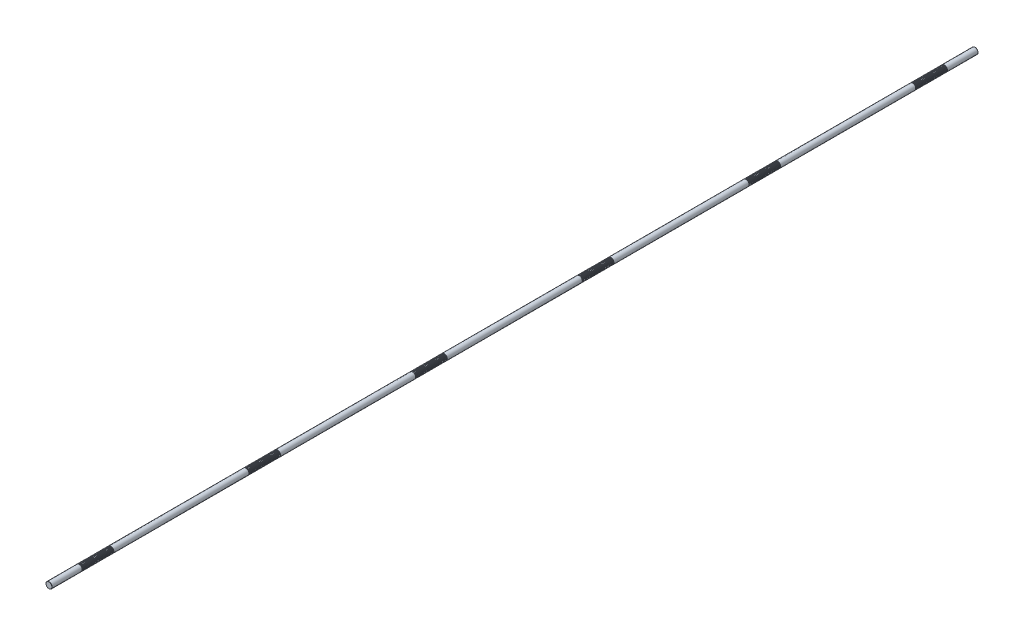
from build123d import *

# Parameters (mm, degrees)
SKETCH1_R           = 10
BOSS_EXTRUDE1_DEPTH = 1500
CHAMFER1_SIZE       = 0.5
LPATTERN1_COUNT     = 26
LPATTERN1_PITCH     = 4
LPATTERN2_COUNT     = 6
LPATTERN2_PITCH     = 540


with BuildPart() as part:
    # Sketch1 → Boss-Extrude1 (new, symmetric)
    with BuildSketch(Plane.XY):
        Circle(SKETCH1_R)
    extrude(amount=BOSS_EXTRUDE1_DEPTH, both=True)

    # Chamfer1
    chamfer1_edges = [part.edges().sort_by_distance(p)[0] for p in [
        (-10, 0, -1500),
        (-10, 0, 1500),
    ]]
    chamfer(chamfer1_edges, length=CHAMFER1_SIZE)

    # Sketch2 → Cut-Revolve1 (revolve, cut)
    with BuildSketch(Plane(origin=(0, 0, 0), x_dir=(0, 0, -1), z_dir=(1, 0, 0)), mode=Mode.PRIVATE) as cut_revolve1_sk:
        Polygon((1400.301442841, 10), (1397.698557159, 10), (1398.301442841, 7.75), (1399.698557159, 7.75), align=None)
    cut_revolve1 = revolve(cut_revolve1_sk.sketch.rotate(Axis((0, 0, 1500), (0, 0, -1)), 90), axis=Axis((0, 0, 1500), (0, 0, -1)), mode=Mode.SUBTRACT)

    # LPattern1: Cut-Revolve1 ×26
    with Locations(*[(0, 0, i * LPATTERN1_PITCH) for i in range(1, LPATTERN1_COUNT)]):
        add(cut_revolve1, mode=Mode.SUBTRACT)

    # LPattern2: Cut-Revolve1 ×6
    with Locations(*[(0, 0, i * LPATTERN2_PITCH) for i in range(1, LPATTERN2_COUNT)]):
        add(cut_revolve1, mode=Mode.SUBTRACT)

    # LPattern2 copy 1 sketch → LPattern2 copy 1 (revolve, cut)
    with BuildSketch(Plane(origin=(0, 0, 544), x_dir=(0, 0, -1), z_dir=(1, 0, 0))):
        Polygon((1400.301442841, 10), (1397.698557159, 10), (1398.301442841, 7.75), (1399.698557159, 7.75), align=None)
    revolve(axis=Axis((0, 0, 2044), (0, 0, -1)), mode=Mode.SUBTRACT)

    # LPattern2 copy 2 sketch → LPattern2 copy 2 (revolve, cut)
    with BuildSketch(Plane(origin=(0, 0, 1084), x_dir=(0, 0, -1), z_dir=(1, 0, 0))):
        Polygon((1400.301442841, 10), (1397.698557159, 10), (1398.301442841, 7.75), (1399.698557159, 7.75), align=None)
    revolve(axis=Axis((0, 0, 2584), (0, 0, -1)), mode=Mode.SUBTRACT)

    # LPattern2 copy 3 sketch → LPattern2 copy 3 (revolve, cut)
    with BuildSketch(Plane(origin=(0, 0, 1624), x_dir=(0, 0, -1), z_dir=(1, 0, 0))):
        Polygon((1400.301442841, 10), (1397.698557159, 10), (1398.301442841, 7.75), (1399.698557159, 7.75), align=None)
    revolve(axis=Axis((0, 0, 3124), (0, 0, -1)), mode=Mode.SUBTRACT)

    # LPattern2 copy 4 sketch → LPattern2 copy 4 (revolve, cut)
    with BuildSketch(Plane(origin=(0, 0, 2164), x_dir=(0, 0, -1), z_dir=(1, 0, 0))):
        Polygon((1400.301442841, 10), (1397.698557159, 10), (1398.301442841, 7.75), (1399.698557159, 7.75), align=None)
    revolve(axis=Axis((0, 0, 3664), (0, 0, -1)), mode=Mode.SUBTRACT)

    # LPattern2 copy 5 sketch → LPattern2 copy 5 (revolve, cut)
    with BuildSketch(Plane(origin=(0, 0, 2704), x_dir=(0, 0, -1), z_dir=(1, 0, 0))):
        Polygon((1400.301442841, 10), (1397.698557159, 10), (1398.301442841, 7.75), (1399.698557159, 7.75), align=None)
    revolve(axis=Axis((0, 0, 4204), (0, 0, -1)), mode=Mode.SUBTRACT)

    # LPattern2 copy 6 sketch → LPattern2 copy 6 (revolve, cut)
    with BuildSketch(Plane(origin=(0, 0, 548), x_dir=(0, 0, -1), z_dir=(1, 0, 0))):
        Polygon((1400.301442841, 10), (1397.698557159, 10), (1398.301442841, 7.75), (1399.698557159, 7.75), align=None)
    revolve(axis=Axis((0, 0, 2048), (0, 0, -1)), mode=Mode.SUBTRACT)

    # LPattern2 copy 7 sketch → LPattern2 copy 7 (revolve, cut)
    with BuildSketch(Plane(origin=(0, 0, 1088), x_dir=(0, 0, -1), z_dir=(1, 0, 0))):
        Polygon((1400.301442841, 10), (1397.698557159, 10), (1398.301442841, 7.75), (1399.698557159, 7.75), align=None)
    revolve(axis=Axis((0, 0, 2588), (0, 0, -1)), mode=Mode.SUBTRACT)

    # LPattern2 copy 8 sketch → LPattern2 copy 8 (revolve, cut)
    with BuildSketch(Plane(origin=(0, 0, 1628), x_dir=(0, 0, -1), z_dir=(1, 0, 0))):
        Polygon((1400.301442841, 10), (1397.698557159, 10), (1398.301442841, 7.75), (1399.698557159, 7.75), align=None)
    revolve(axis=Axis((0, 0, 3128), (0, 0, -1)), mode=Mode.SUBTRACT)

    # LPattern2 copy 9 sketch → LPattern2 copy 9 (revolve, cut)
    with BuildSketch(Plane(origin=(0, 0, 2168), x_dir=(0, 0, -1), z_dir=(1, 0, 0))):
        Polygon((1400.301442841, 10), (1397.698557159, 10), (1398.301442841, 7.75), (1399.698557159, 7.75), align=None)
    revolve(axis=Axis((0, 0, 3668), (0, 0, -1)), mode=Mode.SUBTRACT)

    # LPattern2 copy 10 sketch → LPattern2 copy 10 (revolve, cut)
    with BuildSketch(Plane(origin=(0, 0, 2708), x_dir=(0, 0, -1), z_dir=(1, 0, 0))):
        Polygon((1400.301442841, 10), (1397.698557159, 10), (1398.301442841, 7.75), (1399.698557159, 7.75), align=None)
    revolve(axis=Axis((0, 0, 4208), (0, 0, -1)), mode=Mode.SUBTRACT)

    # LPattern2 copy 11 sketch → LPattern2 copy 11 (revolve, cut)
    with BuildSketch(Plane(origin=(0, 0, 552), x_dir=(0, 0, -1), z_dir=(1, 0, 0))):
        Polygon((1400.301442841, 10), (1397.698557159, 10), (1398.301442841, 7.75), (1399.698557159, 7.75), align=None)
    revolve(axis=Axis((0, 0, 2052), (0, 0, -1)), mode=Mode.SUBTRACT)

    # LPattern2 copy 12 sketch → LPattern2 copy 12 (revolve, cut)
    with BuildSketch(Plane(origin=(0, 0, 1092), x_dir=(0, 0, -1), z_dir=(1, 0, 0))):
        Polygon((1400.301442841, 10), (1397.698557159, 10), (1398.301442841, 7.75), (1399.698557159, 7.75), align=None)
    revolve(axis=Axis((0, 0, 2592), (0, 0, -1)), mode=Mode.SUBTRACT)

    # LPattern2 copy 13 sketch → LPattern2 copy 13 (revolve, cut)
    with BuildSketch(Plane(origin=(0, 0, 1632), x_dir=(0, 0, -1), z_dir=(1, 0, 0))):
        Polygon((1400.301442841, 10), (1397.698557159, 10), (1398.301442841, 7.75), (1399.698557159, 7.75), align=None)
    revolve(axis=Axis((0, 0, 3132), (0, 0, -1)), mode=Mode.SUBTRACT)

    # LPattern2 copy 14 sketch → LPattern2 copy 14 (revolve, cut)
    with BuildSketch(Plane(origin=(0, 0, 2172), x_dir=(0, 0, -1), z_dir=(1, 0, 0))):
        Polygon((1400.301442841, 10), (1397.698557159, 10), (1398.301442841, 7.75), (1399.698557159, 7.75), align=None)
    revolve(axis=Axis((0, 0, 3672), (0, 0, -1)), mode=Mode.SUBTRACT)

    # LPattern2 copy 15 sketch → LPattern2 copy 15 (revolve, cut)
    with BuildSketch(Plane(origin=(0, 0, 2712), x_dir=(0, 0, -1), z_dir=(1, 0, 0))):
        Polygon((1400.301442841, 10), (1397.698557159, 10), (1398.301442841, 7.75), (1399.698557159, 7.75), align=None)
    revolve(axis=Axis((0, 0, 4212), (0, 0, -1)), mode=Mode.SUBTRACT)

    # LPattern2 copy 16 sketch → LPattern2 copy 16 (revolve, cut)
    with BuildSketch(Plane(origin=(0, 0, 556), x_dir=(0, 0, -1), z_dir=(1, 0, 0))):
        Polygon((1400.301442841, 10), (1397.698557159, 10), (1398.301442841, 7.75), (1399.698557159, 7.75), align=None)
    revolve(axis=Axis((0, 0, 2056), (0, 0, -1)), mode=Mode.SUBTRACT)

    # LPattern2 copy 17 sketch → LPattern2 copy 17 (revolve, cut)
    with BuildSketch(Plane(origin=(0, 0, 1096), x_dir=(0, 0, -1), z_dir=(1, 0, 0))):
        Polygon((1400.301442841, 10), (1397.698557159, 10), (1398.301442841, 7.75), (1399.698557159, 7.75), align=None)
    revolve(axis=Axis((0, 0, 2596), (0, 0, -1)), mode=Mode.SUBTRACT)

    # LPattern2 copy 18 sketch → LPattern2 copy 18 (revolve, cut)
    with BuildSketch(Plane(origin=(0, 0, 1636), x_dir=(0, 0, -1), z_dir=(1, 0, 0))):
        Polygon((1400.301442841, 10), (1397.698557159, 10), (1398.301442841, 7.75), (1399.698557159, 7.75), align=None)
    revolve(axis=Axis((0, 0, 3136), (0, 0, -1)), mode=Mode.SUBTRACT)

    # LPattern2 copy 19 sketch → LPattern2 copy 19 (revolve, cut)
    with BuildSketch(Plane(origin=(0, 0, 2176), x_dir=(0, 0, -1), z_dir=(1, 0, 0))):
        Polygon((1400.301442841, 10), (1397.698557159, 10), (1398.301442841, 7.75), (1399.698557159, 7.75), align=None)
    revolve(axis=Axis((0, 0, 3676), (0, 0, -1)), mode=Mode.SUBTRACT)

    # LPattern2 copy 20 sketch → LPattern2 copy 20 (revolve, cut)
    with BuildSketch(Plane(origin=(0, 0, 2716), x_dir=(0, 0, -1), z_dir=(1, 0, 0))):
        Polygon((1400.301442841, 10), (1397.698557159, 10), (1398.301442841, 7.75), (1399.698557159, 7.75), align=None)
    revolve(axis=Axis((0, 0, 4216), (0, 0, -1)), mode=Mode.SUBTRACT)

    # LPattern2 copy 21 sketch → LPattern2 copy 21 (revolve, cut)
    with BuildSketch(Plane(origin=(0, 0, 560), x_dir=(0, 0, -1), z_dir=(1, 0, 0))):
        Polygon((1400.301442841, 10), (1397.698557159, 10), (1398.301442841, 7.75), (1399.698557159, 7.75), align=None)
    revolve(axis=Axis((0, 0, 2060), (0, 0, -1)), mode=Mode.SUBTRACT)

    # LPattern2 copy 22 sketch → LPattern2 copy 22 (revolve, cut)
    with BuildSketch(Plane(origin=(0, 0, 1100), x_dir=(0, 0, -1), z_dir=(1, 0, 0))):
        Polygon((1400.301442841, 10), (1397.698557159, 10), (1398.301442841, 7.75), (1399.698557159, 7.75), align=None)
    revolve(axis=Axis((0, 0, 2600), (0, 0, -1)), mode=Mode.SUBTRACT)

    # LPattern2 copy 23 sketch → LPattern2 copy 23 (revolve, cut)
    with BuildSketch(Plane(origin=(0, 0, 1640), x_dir=(0, 0, -1), z_dir=(1, 0, 0))):
        Polygon((1400.301442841, 10), (1397.698557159, 10), (1398.301442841, 7.75), (1399.698557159, 7.75), align=None)
    revolve(axis=Axis((0, 0, 3140), (0, 0, -1)), mode=Mode.SUBTRACT)

    # LPattern2 copy 24 sketch → LPattern2 copy 24 (revolve, cut)
    with BuildSketch(Plane(origin=(0, 0, 2180), x_dir=(0, 0, -1), z_dir=(1, 0, 0))):
        Polygon((1400.301442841, 10), (1397.698557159, 10), (1398.301442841, 7.75), (1399.698557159, 7.75), align=None)
    revolve(axis=Axis((0, 0, 3680), (0, 0, -1)), mode=Mode.SUBTRACT)

    # LPattern2 copy 25 sketch → LPattern2 copy 25 (revolve, cut)
    with BuildSketch(Plane(origin=(0, 0, 2720), x_dir=(0, 0, -1), z_dir=(1, 0, 0))):
        Polygon((1400.301442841, 10), (1397.698557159, 10), (1398.301442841, 7.75), (1399.698557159, 7.75), align=None)
    revolve(axis=Axis((0, 0, 4220), (0, 0, -1)), mode=Mode.SUBTRACT)

    # LPattern2 copy 26 sketch → LPattern2 copy 26 (revolve, cut)
    with BuildSketch(Plane(origin=(0, 0, 564), x_dir=(0, 0, -1), z_dir=(1, 0, 0))):
        Polygon((1400.301442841, 10), (1397.698557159, 10), (1398.301442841, 7.75), (1399.698557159, 7.75), align=None)
    revolve(axis=Axis((0, 0, 2064), (0, 0, -1)), mode=Mode.SUBTRACT)

    # LPattern2 copy 27 sketch → LPattern2 copy 27 (revolve, cut)
    with BuildSketch(Plane(origin=(0, 0, 1104), x_dir=(0, 0, -1), z_dir=(1, 0, 0))):
        Polygon((1400.301442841, 10), (1397.698557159, 10), (1398.301442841, 7.75), (1399.698557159, 7.75), align=None)
    revolve(axis=Axis((0, 0, 2604), (0, 0, -1)), mode=Mode.SUBTRACT)

    # LPattern2 copy 28 sketch → LPattern2 copy 28 (revolve, cut)
    with BuildSketch(Plane(origin=(0, 0, 1644), x_dir=(0, 0, -1), z_dir=(1, 0, 0))):
        Polygon((1400.301442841, 10), (1397.698557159, 10), (1398.301442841, 7.75), (1399.698557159, 7.75), align=None)
    revolve(axis=Axis((0, 0, 3144), (0, 0, -1)), mode=Mode.SUBTRACT)

    # LPattern2 copy 29 sketch → LPattern2 copy 29 (revolve, cut)
    with BuildSketch(Plane(origin=(0, 0, 2184), x_dir=(0, 0, -1), z_dir=(1, 0, 0))):
        Polygon((1400.301442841, 10), (1397.698557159, 10), (1398.301442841, 7.75), (1399.698557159, 7.75), align=None)
    revolve(axis=Axis((0, 0, 3684), (0, 0, -1)), mode=Mode.SUBTRACT)

    # LPattern2 copy 30 sketch → LPattern2 copy 30 (revolve, cut)
    with BuildSketch(Plane(origin=(0, 0, 2724), x_dir=(0, 0, -1), z_dir=(1, 0, 0))):
        Polygon((1400.301442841, 10), (1397.698557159, 10), (1398.301442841, 7.75), (1399.698557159, 7.75), align=None)
    revolve(axis=Axis((0, 0, 4224), (0, 0, -1)), mode=Mode.SUBTRACT)

    # LPattern2 copy 31 sketch → LPattern2 copy 31 (revolve, cut)
    with BuildSketch(Plane(origin=(0, 0, 568), x_dir=(0, 0, -1), z_dir=(1, 0, 0))):
        Polygon((1400.301442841, 10), (1397.698557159, 10), (1398.301442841, 7.75), (1399.698557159, 7.75), align=None)
    revolve(axis=Axis((0, 0, 2068), (0, 0, -1)), mode=Mode.SUBTRACT)

    # LPattern2 copy 32 sketch → LPattern2 copy 32 (revolve, cut)
    with BuildSketch(Plane(origin=(0, 0, 1108), x_dir=(0, 0, -1), z_dir=(1, 0, 0))):
        Polygon((1400.301442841, 10), (1397.698557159, 10), (1398.301442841, 7.75), (1399.698557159, 7.75), align=None)
    revolve(axis=Axis((0, 0, 2608), (0, 0, -1)), mode=Mode.SUBTRACT)

    # LPattern2 copy 33 sketch → LPattern2 copy 33 (revolve, cut)
    with BuildSketch(Plane(origin=(0, 0, 1648), x_dir=(0, 0, -1), z_dir=(1, 0, 0))):
        Polygon((1400.301442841, 10), (1397.698557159, 10), (1398.301442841, 7.75), (1399.698557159, 7.75), align=None)
    revolve(axis=Axis((0, 0, 3148), (0, 0, -1)), mode=Mode.SUBTRACT)

    # LPattern2 copy 34 sketch → LPattern2 copy 34 (revolve, cut)
    with BuildSketch(Plane(origin=(0, 0, 2188), x_dir=(0, 0, -1), z_dir=(1, 0, 0))):
        Polygon((1400.301442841, 10), (1397.698557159, 10), (1398.301442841, 7.75), (1399.698557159, 7.75), align=None)
    revolve(axis=Axis((0, 0, 3688), (0, 0, -1)), mode=Mode.SUBTRACT)

    # LPattern2 copy 35 sketch → LPattern2 copy 35 (revolve, cut)
    with BuildSketch(Plane(origin=(0, 0, 2728), x_dir=(0, 0, -1), z_dir=(1, 0, 0))):
        Polygon((1400.301442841, 10), (1397.698557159, 10), (1398.301442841, 7.75), (1399.698557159, 7.75), align=None)
    revolve(axis=Axis((0, 0, 4228), (0, 0, -1)), mode=Mode.SUBTRACT)

    # LPattern2 copy 36 sketch → LPattern2 copy 36 (revolve, cut)
    with BuildSketch(Plane(origin=(0, 0, 572), x_dir=(0, 0, -1), z_dir=(1, 0, 0))):
        Polygon((1400.301442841, 10), (1397.698557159, 10), (1398.301442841, 7.75), (1399.698557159, 7.75), align=None)
    revolve(axis=Axis((0, 0, 2072), (0, 0, -1)), mode=Mode.SUBTRACT)

    # LPattern2 copy 37 sketch → LPattern2 copy 37 (revolve, cut)
    with BuildSketch(Plane(origin=(0, 0, 1112), x_dir=(0, 0, -1), z_dir=(1, 0, 0))):
        Polygon((1400.301442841, 10), (1397.698557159, 10), (1398.301442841, 7.75), (1399.698557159, 7.75), align=None)
    revolve(axis=Axis((0, 0, 2612), (0, 0, -1)), mode=Mode.SUBTRACT)

    # LPattern2 copy 38 sketch → LPattern2 copy 38 (revolve, cut)
    with BuildSketch(Plane(origin=(0, 0, 1652), x_dir=(0, 0, -1), z_dir=(1, 0, 0))):
        Polygon((1400.301442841, 10), (1397.698557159, 10), (1398.301442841, 7.75), (1399.698557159, 7.75), align=None)
    revolve(axis=Axis((0, 0, 3152), (0, 0, -1)), mode=Mode.SUBTRACT)

    # LPattern2 copy 39 sketch → LPattern2 copy 39 (revolve, cut)
    with BuildSketch(Plane(origin=(0, 0, 2192), x_dir=(0, 0, -1), z_dir=(1, 0, 0))):
        Polygon((1400.301442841, 10), (1397.698557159, 10), (1398.301442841, 7.75), (1399.698557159, 7.75), align=None)
    revolve(axis=Axis((0, 0, 3692), (0, 0, -1)), mode=Mode.SUBTRACT)

    # LPattern2 copy 40 sketch → LPattern2 copy 40 (revolve, cut)
    with BuildSketch(Plane(origin=(0, 0, 2732), x_dir=(0, 0, -1), z_dir=(1, 0, 0))):
        Polygon((1400.301442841, 10), (1397.698557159, 10), (1398.301442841, 7.75), (1399.698557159, 7.75), align=None)
    revolve(axis=Axis((0, 0, 4232), (0, 0, -1)), mode=Mode.SUBTRACT)

    # LPattern2 copy 41 sketch → LPattern2 copy 41 (revolve, cut)
    with BuildSketch(Plane(origin=(0, 0, 576), x_dir=(0, 0, -1), z_dir=(1, 0, 0))):
        Polygon((1400.301442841, 10), (1397.698557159, 10), (1398.301442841, 7.75), (1399.698557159, 7.75), align=None)
    revolve(axis=Axis((0, 0, 2076), (0, 0, -1)), mode=Mode.SUBTRACT)

    # LPattern2 copy 42 sketch → LPattern2 copy 42 (revolve, cut)
    with BuildSketch(Plane(origin=(0, 0, 1116), x_dir=(0, 0, -1), z_dir=(1, 0, 0))):
        Polygon((1400.301442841, 10), (1397.698557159, 10), (1398.301442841, 7.75), (1399.698557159, 7.75), align=None)
    revolve(axis=Axis((0, 0, 2616), (0, 0, -1)), mode=Mode.SUBTRACT)

    # LPattern2 copy 43 sketch → LPattern2 copy 43 (revolve, cut)
    with BuildSketch(Plane(origin=(0, 0, 1656), x_dir=(0, 0, -1), z_dir=(1, 0, 0))):
        Polygon((1400.301442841, 10), (1397.698557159, 10), (1398.301442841, 7.75), (1399.698557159, 7.75), align=None)
    revolve(axis=Axis((0, 0, 3156), (0, 0, -1)), mode=Mode.SUBTRACT)

    # LPattern2 copy 44 sketch → LPattern2 copy 44 (revolve, cut)
    with BuildSketch(Plane(origin=(0, 0, 2196), x_dir=(0, 0, -1), z_dir=(1, 0, 0))):
        Polygon((1400.301442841, 10), (1397.698557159, 10), (1398.301442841, 7.75), (1399.698557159, 7.75), align=None)
    revolve(axis=Axis((0, 0, 3696), (0, 0, -1)), mode=Mode.SUBTRACT)

    # LPattern2 copy 45 sketch → LPattern2 copy 45 (revolve, cut)
    with BuildSketch(Plane(origin=(0, 0, 2736), x_dir=(0, 0, -1), z_dir=(1, 0, 0))):
        Polygon((1400.301442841, 10), (1397.698557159, 10), (1398.301442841, 7.75), (1399.698557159, 7.75), align=None)
    revolve(axis=Axis((0, 0, 4236), (0, 0, -1)), mode=Mode.SUBTRACT)

    # LPattern2 copy 46 sketch → LPattern2 copy 46 (revolve, cut)
    with BuildSketch(Plane(origin=(0, 0, 580), x_dir=(0, 0, -1), z_dir=(1, 0, 0))):
        Polygon((1400.301442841, 10), (1397.698557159, 10), (1398.301442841, 7.75), (1399.698557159, 7.75), align=None)
    revolve(axis=Axis((0, 0, 2080), (0, 0, -1)), mode=Mode.SUBTRACT)

    # LPattern2 copy 47 sketch → LPattern2 copy 47 (revolve, cut)
    with BuildSketch(Plane(origin=(0, 0, 1120), x_dir=(0, 0, -1), z_dir=(1, 0, 0))):
        Polygon((1400.301442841, 10), (1397.698557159, 10), (1398.301442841, 7.75), (1399.698557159, 7.75), align=None)
    revolve(axis=Axis((0, 0, 2620), (0, 0, -1)), mode=Mode.SUBTRACT)

    # LPattern2 copy 48 sketch → LPattern2 copy 48 (revolve, cut)
    with BuildSketch(Plane(origin=(0, 0, 1660), x_dir=(0, 0, -1), z_dir=(1, 0, 0))):
        Polygon((1400.301442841, 10), (1397.698557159, 10), (1398.301442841, 7.75), (1399.698557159, 7.75), align=None)
    revolve(axis=Axis((0, 0, 3160), (0, 0, -1)), mode=Mode.SUBTRACT)

    # LPattern2 copy 49 sketch → LPattern2 copy 49 (revolve, cut)
    with BuildSketch(Plane(origin=(0, 0, 2200), x_dir=(0, 0, -1), z_dir=(1, 0, 0))):
        Polygon((1400.301442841, 10), (1397.698557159, 10), (1398.301442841, 7.75), (1399.698557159, 7.75), align=None)
    revolve(axis=Axis((0, 0, 3700), (0, 0, -1)), mode=Mode.SUBTRACT)

    # LPattern2 copy 50 sketch → LPattern2 copy 50 (revolve, cut)
    with BuildSketch(Plane(origin=(0, 0, 2740), x_dir=(0, 0, -1), z_dir=(1, 0, 0))):
        Polygon((1400.301442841, 10), (1397.698557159, 10), (1398.301442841, 7.75), (1399.698557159, 7.75), align=None)
    revolve(axis=Axis((0, 0, 4240), (0, 0, -1)), mode=Mode.SUBTRACT)

    # LPattern2 copy 51 sketch → LPattern2 copy 51 (revolve, cut)
    with BuildSketch(Plane(origin=(0, 0, 584), x_dir=(0, 0, -1), z_dir=(1, 0, 0))):
        Polygon((1400.301442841, 10), (1397.698557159, 10), (1398.301442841, 7.75), (1399.698557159, 7.75), align=None)
    revolve(axis=Axis((0, 0, 2084), (0, 0, -1)), mode=Mode.SUBTRACT)

    # LPattern2 copy 52 sketch → LPattern2 copy 52 (revolve, cut)
    with BuildSketch(Plane(origin=(0, 0, 1124), x_dir=(0, 0, -1), z_dir=(1, 0, 0))):
        Polygon((1400.301442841, 10), (1397.698557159, 10), (1398.301442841, 7.75), (1399.698557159, 7.75), align=None)
    revolve(axis=Axis((0, 0, 2624), (0, 0, -1)), mode=Mode.SUBTRACT)

    # LPattern2 copy 53 sketch → LPattern2 copy 53 (revolve, cut)
    with BuildSketch(Plane(origin=(0, 0, 1664), x_dir=(0, 0, -1), z_dir=(1, 0, 0))):
        Polygon((1400.301442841, 10), (1397.698557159, 10), (1398.301442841, 7.75), (1399.698557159, 7.75), align=None)
    revolve(axis=Axis((0, 0, 3164), (0, 0, -1)), mode=Mode.SUBTRACT)

    # LPattern2 copy 54 sketch → LPattern2 copy 54 (revolve, cut)
    with BuildSketch(Plane(origin=(0, 0, 2204), x_dir=(0, 0, -1), z_dir=(1, 0, 0))):
        Polygon((1400.301442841, 10), (1397.698557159, 10), (1398.301442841, 7.75), (1399.698557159, 7.75), align=None)
    revolve(axis=Axis((0, 0, 3704), (0, 0, -1)), mode=Mode.SUBTRACT)

    # LPattern2 copy 55 sketch → LPattern2 copy 55 (revolve, cut)
    with BuildSketch(Plane(origin=(0, 0, 2744), x_dir=(0, 0, -1), z_dir=(1, 0, 0))):
        Polygon((1400.301442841, 10), (1397.698557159, 10), (1398.301442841, 7.75), (1399.698557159, 7.75), align=None)
    revolve(axis=Axis((0, 0, 4244), (0, 0, -1)), mode=Mode.SUBTRACT)

    # LPattern2 copy 56 sketch → LPattern2 copy 56 (revolve, cut)
    with BuildSketch(Plane(origin=(0, 0, 588), x_dir=(0, 0, -1), z_dir=(1, 0, 0))):
        Polygon((1400.301442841, 10), (1397.698557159, 10), (1398.301442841, 7.75), (1399.698557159, 7.75), align=None)
    revolve(axis=Axis((0, 0, 2088), (0, 0, -1)), mode=Mode.SUBTRACT)

    # LPattern2 copy 57 sketch → LPattern2 copy 57 (revolve, cut)
    with BuildSketch(Plane(origin=(0, 0, 1128), x_dir=(0, 0, -1), z_dir=(1, 0, 0))):
        Polygon((1400.301442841, 10), (1397.698557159, 10), (1398.301442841, 7.75), (1399.698557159, 7.75), align=None)
    revolve(axis=Axis((0, 0, 2628), (0, 0, -1)), mode=Mode.SUBTRACT)

    # LPattern2 copy 58 sketch → LPattern2 copy 58 (revolve, cut)
    with BuildSketch(Plane(origin=(0, 0, 1668), x_dir=(0, 0, -1), z_dir=(1, 0, 0))):
        Polygon((1400.301442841, 10), (1397.698557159, 10), (1398.301442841, 7.75), (1399.698557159, 7.75), align=None)
    revolve(axis=Axis((0, 0, 3168), (0, 0, -1)), mode=Mode.SUBTRACT)

    # LPattern2 copy 59 sketch → LPattern2 copy 59 (revolve, cut)
    with BuildSketch(Plane(origin=(0, 0, 2208), x_dir=(0, 0, -1), z_dir=(1, 0, 0))):
        Polygon((1400.301442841, 10), (1397.698557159, 10), (1398.301442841, 7.75), (1399.698557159, 7.75), align=None)
    revolve(axis=Axis((0, 0, 3708), (0, 0, -1)), mode=Mode.SUBTRACT)

    # LPattern2 copy 60 sketch → LPattern2 copy 60 (revolve, cut)
    with BuildSketch(Plane(origin=(0, 0, 2748), x_dir=(0, 0, -1), z_dir=(1, 0, 0))):
        Polygon((1400.301442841, 10), (1397.698557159, 10), (1398.301442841, 7.75), (1399.698557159, 7.75), align=None)
    revolve(axis=Axis((0, 0, 4248), (0, 0, -1)), mode=Mode.SUBTRACT)

    # LPattern2 copy 61 sketch → LPattern2 copy 61 (revolve, cut)
    with BuildSketch(Plane(origin=(0, 0, 592), x_dir=(0, 0, -1), z_dir=(1, 0, 0))):
        Polygon((1400.301442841, 10), (1397.698557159, 10), (1398.301442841, 7.75), (1399.698557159, 7.75), align=None)
    revolve(axis=Axis((0, 0, 2092), (0, 0, -1)), mode=Mode.SUBTRACT)

    # LPattern2 copy 62 sketch → LPattern2 copy 62 (revolve, cut)
    with BuildSketch(Plane(origin=(0, 0, 1132), x_dir=(0, 0, -1), z_dir=(1, 0, 0))):
        Polygon((1400.301442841, 10), (1397.698557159, 10), (1398.301442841, 7.75), (1399.698557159, 7.75), align=None)
    revolve(axis=Axis((0, 0, 2632), (0, 0, -1)), mode=Mode.SUBTRACT)

    # LPattern2 copy 63 sketch → LPattern2 copy 63 (revolve, cut)
    with BuildSketch(Plane(origin=(0, 0, 1672), x_dir=(0, 0, -1), z_dir=(1, 0, 0))):
        Polygon((1400.301442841, 10), (1397.698557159, 10), (1398.301442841, 7.75), (1399.698557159, 7.75), align=None)
    revolve(axis=Axis((0, 0, 3172), (0, 0, -1)), mode=Mode.SUBTRACT)

    # LPattern2 copy 64 sketch → LPattern2 copy 64 (revolve, cut)
    with BuildSketch(Plane(origin=(0, 0, 2212), x_dir=(0, 0, -1), z_dir=(1, 0, 0))):
        Polygon((1400.301442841, 10), (1397.698557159, 10), (1398.301442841, 7.75), (1399.698557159, 7.75), align=None)
    revolve(axis=Axis((0, 0, 3712), (0, 0, -1)), mode=Mode.SUBTRACT)

    # LPattern2 copy 65 sketch → LPattern2 copy 65 (revolve, cut)
    with BuildSketch(Plane(origin=(0, 0, 2752), x_dir=(0, 0, -1), z_dir=(1, 0, 0))):
        Polygon((1400.301442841, 10), (1397.698557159, 10), (1398.301442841, 7.75), (1399.698557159, 7.75), align=None)
    revolve(axis=Axis((0, 0, 4252), (0, 0, -1)), mode=Mode.SUBTRACT)

    # LPattern2 copy 66 sketch → LPattern2 copy 66 (revolve, cut)
    with BuildSketch(Plane(origin=(0, 0, 596), x_dir=(0, 0, -1), z_dir=(1, 0, 0))):
        Polygon((1400.301442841, 10), (1397.698557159, 10), (1398.301442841, 7.75), (1399.698557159, 7.75), align=None)
    revolve(axis=Axis((0, 0, 2096), (0, 0, -1)), mode=Mode.SUBTRACT)

    # LPattern2 copy 67 sketch → LPattern2 copy 67 (revolve, cut)
    with BuildSketch(Plane(origin=(0, 0, 1136), x_dir=(0, 0, -1), z_dir=(1, 0, 0))):
        Polygon((1400.301442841, 10), (1397.698557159, 10), (1398.301442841, 7.75), (1399.698557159, 7.75), align=None)
    revolve(axis=Axis((0, 0, 2636), (0, 0, -1)), mode=Mode.SUBTRACT)

    # LPattern2 copy 68 sketch → LPattern2 copy 68 (revolve, cut)
    with BuildSketch(Plane(origin=(0, 0, 1676), x_dir=(0, 0, -1), z_dir=(1, 0, 0))):
        Polygon((1400.301442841, 10), (1397.698557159, 10), (1398.301442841, 7.75), (1399.698557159, 7.75), align=None)
    revolve(axis=Axis((0, 0, 3176), (0, 0, -1)), mode=Mode.SUBTRACT)

    # LPattern2 copy 69 sketch → LPattern2 copy 69 (revolve, cut)
    with BuildSketch(Plane(origin=(0, 0, 2216), x_dir=(0, 0, -1), z_dir=(1, 0, 0))):
        Polygon((1400.301442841, 10), (1397.698557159, 10), (1398.301442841, 7.75), (1399.698557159, 7.75), align=None)
    revolve(axis=Axis((0, 0, 3716), (0, 0, -1)), mode=Mode.SUBTRACT)

    # LPattern2 copy 70 sketch → LPattern2 copy 70 (revolve, cut)
    with BuildSketch(Plane(origin=(0, 0, 2756), x_dir=(0, 0, -1), z_dir=(1, 0, 0))):
        Polygon((1400.301442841, 10), (1397.698557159, 10), (1398.301442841, 7.75), (1399.698557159, 7.75), align=None)
    revolve(axis=Axis((0, 0, 4256), (0, 0, -1)), mode=Mode.SUBTRACT)

    # LPattern2 copy 71 sketch → LPattern2 copy 71 (revolve, cut)
    with BuildSketch(Plane(origin=(0, 0, 600), x_dir=(0, 0, -1), z_dir=(1, 0, 0))):
        Polygon((1400.301442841, 10), (1397.698557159, 10), (1398.301442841, 7.75), (1399.698557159, 7.75), align=None)
    revolve(axis=Axis((0, 0, 2100), (0, 0, -1)), mode=Mode.SUBTRACT)

    # LPattern2 copy 72 sketch → LPattern2 copy 72 (revolve, cut)
    with BuildSketch(Plane(origin=(0, 0, 1140), x_dir=(0, 0, -1), z_dir=(1, 0, 0))):
        Polygon((1400.301442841, 10), (1397.698557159, 10), (1398.301442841, 7.75), (1399.698557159, 7.75), align=None)
    revolve(axis=Axis((0, 0, 2640), (0, 0, -1)), mode=Mode.SUBTRACT)

    # LPattern2 copy 73 sketch → LPattern2 copy 73 (revolve, cut)
    with BuildSketch(Plane(origin=(0, 0, 1680), x_dir=(0, 0, -1), z_dir=(1, 0, 0))):
        Polygon((1400.301442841, 10), (1397.698557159, 10), (1398.301442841, 7.75), (1399.698557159, 7.75), align=None)
    revolve(axis=Axis((0, 0, 3180), (0, 0, -1)), mode=Mode.SUBTRACT)

    # LPattern2 copy 74 sketch → LPattern2 copy 74 (revolve, cut)
    with BuildSketch(Plane(origin=(0, 0, 2220), x_dir=(0, 0, -1), z_dir=(1, 0, 0))):
        Polygon((1400.301442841, 10), (1397.698557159, 10), (1398.301442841, 7.75), (1399.698557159, 7.75), align=None)
    revolve(axis=Axis((0, 0, 3720), (0, 0, -1)), mode=Mode.SUBTRACT)

    # LPattern2 copy 75 sketch → LPattern2 copy 75 (revolve, cut)
    with BuildSketch(Plane(origin=(0, 0, 2760), x_dir=(0, 0, -1), z_dir=(1, 0, 0))):
        Polygon((1400.301442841, 10), (1397.698557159, 10), (1398.301442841, 7.75), (1399.698557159, 7.75), align=None)
    revolve(axis=Axis((0, 0, 4260), (0, 0, -1)), mode=Mode.SUBTRACT)

    # LPattern2 copy 76 sketch → LPattern2 copy 76 (revolve, cut)
    with BuildSketch(Plane(origin=(0, 0, 604), x_dir=(0, 0, -1), z_dir=(1, 0, 0))):
        Polygon((1400.301442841, 10), (1397.698557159, 10), (1398.301442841, 7.75), (1399.698557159, 7.75), align=None)
    revolve(axis=Axis((0, 0, 2104), (0, 0, -1)), mode=Mode.SUBTRACT)

    # LPattern2 copy 77 sketch → LPattern2 copy 77 (revolve, cut)
    with BuildSketch(Plane(origin=(0, 0, 1144), x_dir=(0, 0, -1), z_dir=(1, 0, 0))):
        Polygon((1400.301442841, 10), (1397.698557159, 10), (1398.301442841, 7.75), (1399.698557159, 7.75), align=None)
    revolve(axis=Axis((0, 0, 2644), (0, 0, -1)), mode=Mode.SUBTRACT)

    # LPattern2 copy 78 sketch → LPattern2 copy 78 (revolve, cut)
    with BuildSketch(Plane(origin=(0, 0, 1684), x_dir=(0, 0, -1), z_dir=(1, 0, 0))):
        Polygon((1400.301442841, 10), (1397.698557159, 10), (1398.301442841, 7.75), (1399.698557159, 7.75), align=None)
    revolve(axis=Axis((0, 0, 3184), (0, 0, -1)), mode=Mode.SUBTRACT)

    # LPattern2 copy 79 sketch → LPattern2 copy 79 (revolve, cut)
    with BuildSketch(Plane(origin=(0, 0, 2224), x_dir=(0, 0, -1), z_dir=(1, 0, 0))):
        Polygon((1400.301442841, 10), (1397.698557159, 10), (1398.301442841, 7.75), (1399.698557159, 7.75), align=None)
    revolve(axis=Axis((0, 0, 3724), (0, 0, -1)), mode=Mode.SUBTRACT)

    # LPattern2 copy 80 sketch → LPattern2 copy 80 (revolve, cut)
    with BuildSketch(Plane(origin=(0, 0, 2764), x_dir=(0, 0, -1), z_dir=(1, 0, 0))):
        Polygon((1400.301442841, 10), (1397.698557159, 10), (1398.301442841, 7.75), (1399.698557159, 7.75), align=None)
    revolve(axis=Axis((0, 0, 4264), (0, 0, -1)), mode=Mode.SUBTRACT)

    # LPattern2 copy 81 sketch → LPattern2 copy 81 (revolve, cut)
    with BuildSketch(Plane(origin=(0, 0, 608), x_dir=(0, 0, -1), z_dir=(1, 0, 0))):
        Polygon((1400.301442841, 10), (1397.698557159, 10), (1398.301442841, 7.75), (1399.698557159, 7.75), align=None)
    revolve(axis=Axis((0, 0, 2108), (0, 0, -1)), mode=Mode.SUBTRACT)

    # LPattern2 copy 82 sketch → LPattern2 copy 82 (revolve, cut)
    with BuildSketch(Plane(origin=(0, 0, 1148), x_dir=(0, 0, -1), z_dir=(1, 0, 0))):
        Polygon((1400.301442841, 10), (1397.698557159, 10), (1398.301442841, 7.75), (1399.698557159, 7.75), align=None)
    revolve(axis=Axis((0, 0, 2648), (0, 0, -1)), mode=Mode.SUBTRACT)

    # LPattern2 copy 83 sketch → LPattern2 copy 83 (revolve, cut)
    with BuildSketch(Plane(origin=(0, 0, 1688), x_dir=(0, 0, -1), z_dir=(1, 0, 0))):
        Polygon((1400.301442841, 10), (1397.698557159, 10), (1398.301442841, 7.75), (1399.698557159, 7.75), align=None)
    revolve(axis=Axis((0, 0, 3188), (0, 0, -1)), mode=Mode.SUBTRACT)

    # LPattern2 copy 84 sketch → LPattern2 copy 84 (revolve, cut)
    with BuildSketch(Plane(origin=(0, 0, 2228), x_dir=(0, 0, -1), z_dir=(1, 0, 0))):
        Polygon((1400.301442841, 10), (1397.698557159, 10), (1398.301442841, 7.75), (1399.698557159, 7.75), align=None)
    revolve(axis=Axis((0, 0, 3728), (0, 0, -1)), mode=Mode.SUBTRACT)

    # LPattern2 copy 85 sketch → LPattern2 copy 85 (revolve, cut)
    with BuildSketch(Plane(origin=(0, 0, 2768), x_dir=(0, 0, -1), z_dir=(1, 0, 0))):
        Polygon((1400.301442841, 10), (1397.698557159, 10), (1398.301442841, 7.75), (1399.698557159, 7.75), align=None)
    revolve(axis=Axis((0, 0, 4268), (0, 0, -1)), mode=Mode.SUBTRACT)

    # LPattern2 copy 86 sketch → LPattern2 copy 86 (revolve, cut)
    with BuildSketch(Plane(origin=(0, 0, 612), x_dir=(0, 0, -1), z_dir=(1, 0, 0))):
        Polygon((1400.301442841, 10), (1397.698557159, 10), (1398.301442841, 7.75), (1399.698557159, 7.75), align=None)
    revolve(axis=Axis((0, 0, 2112), (0, 0, -1)), mode=Mode.SUBTRACT)

    # LPattern2 copy 87 sketch → LPattern2 copy 87 (revolve, cut)
    with BuildSketch(Plane(origin=(0, 0, 1152), x_dir=(0, 0, -1), z_dir=(1, 0, 0))):
        Polygon((1400.301442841, 10), (1397.698557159, 10), (1398.301442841, 7.75), (1399.698557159, 7.75), align=None)
    revolve(axis=Axis((0, 0, 2652), (0, 0, -1)), mode=Mode.SUBTRACT)

    # LPattern2 copy 88 sketch → LPattern2 copy 88 (revolve, cut)
    with BuildSketch(Plane(origin=(0, 0, 1692), x_dir=(0, 0, -1), z_dir=(1, 0, 0))):
        Polygon((1400.301442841, 10), (1397.698557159, 10), (1398.301442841, 7.75), (1399.698557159, 7.75), align=None)
    revolve(axis=Axis((0, 0, 3192), (0, 0, -1)), mode=Mode.SUBTRACT)

    # LPattern2 copy 89 sketch → LPattern2 copy 89 (revolve, cut)
    with BuildSketch(Plane(origin=(0, 0, 2232), x_dir=(0, 0, -1), z_dir=(1, 0, 0))):
        Polygon((1400.301442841, 10), (1397.698557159, 10), (1398.301442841, 7.75), (1399.698557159, 7.75), align=None)
    revolve(axis=Axis((0, 0, 3732), (0, 0, -1)), mode=Mode.SUBTRACT)

    # LPattern2 copy 90 sketch → LPattern2 copy 90 (revolve, cut)
    with BuildSketch(Plane(origin=(0, 0, 2772), x_dir=(0, 0, -1), z_dir=(1, 0, 0))):
        Polygon((1400.301442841, 10), (1397.698557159, 10), (1398.301442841, 7.75), (1399.698557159, 7.75), align=None)
    revolve(axis=Axis((0, 0, 4272), (0, 0, -1)), mode=Mode.SUBTRACT)

    # LPattern2 copy 91 sketch → LPattern2 copy 91 (revolve, cut)
    with BuildSketch(Plane(origin=(0, 0, 616), x_dir=(0, 0, -1), z_dir=(1, 0, 0))):
        Polygon((1400.301442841, 10), (1397.698557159, 10), (1398.301442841, 7.75), (1399.698557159, 7.75), align=None)
    revolve(axis=Axis((0, 0, 2116), (0, 0, -1)), mode=Mode.SUBTRACT)

    # LPattern2 copy 92 sketch → LPattern2 copy 92 (revolve, cut)
    with BuildSketch(Plane(origin=(0, 0, 1156), x_dir=(0, 0, -1), z_dir=(1, 0, 0))):
        Polygon((1400.301442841, 10), (1397.698557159, 10), (1398.301442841, 7.75), (1399.698557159, 7.75), align=None)
    revolve(axis=Axis((0, 0, 2656), (0, 0, -1)), mode=Mode.SUBTRACT)

    # LPattern2 copy 93 sketch → LPattern2 copy 93 (revolve, cut)
    with BuildSketch(Plane(origin=(0, 0, 1696), x_dir=(0, 0, -1), z_dir=(1, 0, 0))):
        Polygon((1400.301442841, 10), (1397.698557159, 10), (1398.301442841, 7.75), (1399.698557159, 7.75), align=None)
    revolve(axis=Axis((0, 0, 3196), (0, 0, -1)), mode=Mode.SUBTRACT)

    # LPattern2 copy 94 sketch → LPattern2 copy 94 (revolve, cut)
    with BuildSketch(Plane(origin=(0, 0, 2236), x_dir=(0, 0, -1), z_dir=(1, 0, 0))):
        Polygon((1400.301442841, 10), (1397.698557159, 10), (1398.301442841, 7.75), (1399.698557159, 7.75), align=None)
    revolve(axis=Axis((0, 0, 3736), (0, 0, -1)), mode=Mode.SUBTRACT)

    # LPattern2 copy 95 sketch → LPattern2 copy 95 (revolve, cut)
    with BuildSketch(Plane(origin=(0, 0, 2776), x_dir=(0, 0, -1), z_dir=(1, 0, 0))):
        Polygon((1400.301442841, 10), (1397.698557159, 10), (1398.301442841, 7.75), (1399.698557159, 7.75), align=None)
    revolve(axis=Axis((0, 0, 4276), (0, 0, -1)), mode=Mode.SUBTRACT)

    # LPattern2 copy 96 sketch → LPattern2 copy 96 (revolve, cut)
    with BuildSketch(Plane(origin=(0, 0, 620), x_dir=(0, 0, -1), z_dir=(1, 0, 0))):
        Polygon((1400.301442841, 10), (1397.698557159, 10), (1398.301442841, 7.75), (1399.698557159, 7.75), align=None)
    revolve(axis=Axis((0, 0, 2120), (0, 0, -1)), mode=Mode.SUBTRACT)

    # LPattern2 copy 97 sketch → LPattern2 copy 97 (revolve, cut)
    with BuildSketch(Plane(origin=(0, 0, 1160), x_dir=(0, 0, -1), z_dir=(1, 0, 0))):
        Polygon((1400.301442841, 10), (1397.698557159, 10), (1398.301442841, 7.75), (1399.698557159, 7.75), align=None)
    revolve(axis=Axis((0, 0, 2660), (0, 0, -1)), mode=Mode.SUBTRACT)

    # LPattern2 copy 98 sketch → LPattern2 copy 98 (revolve, cut)
    with BuildSketch(Plane(origin=(0, 0, 1700), x_dir=(0, 0, -1), z_dir=(1, 0, 0))):
        Polygon((1400.301442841, 10), (1397.698557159, 10), (1398.301442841, 7.75), (1399.698557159, 7.75), align=None)
    revolve(axis=Axis((0, 0, 3200), (0, 0, -1)), mode=Mode.SUBTRACT)

    # LPattern2 copy 99 sketch → LPattern2 copy 99 (revolve, cut)
    with BuildSketch(Plane(origin=(0, 0, 2240), x_dir=(0, 0, -1), z_dir=(1, 0, 0))):
        Polygon((1400.301442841, 10), (1397.698557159, 10), (1398.301442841, 7.75), (1399.698557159, 7.75), align=None)
    revolve(axis=Axis((0, 0, 3740), (0, 0, -1)), mode=Mode.SUBTRACT)

    # LPattern2 copy 100 sketch → LPattern2 copy 100 (revolve, cut)
    with BuildSketch(Plane(origin=(0, 0, 2780), x_dir=(0, 0, -1), z_dir=(1, 0, 0))):
        Polygon((1400.301442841, 10), (1397.698557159, 10), (1398.301442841, 7.75), (1399.698557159, 7.75), align=None)
    revolve(axis=Axis((0, 0, 4280), (0, 0, -1)), mode=Mode.SUBTRACT)

    # LPattern2 copy 101 sketch → LPattern2 copy 101 (revolve, cut)
    with BuildSketch(Plane(origin=(0, 0, 624), x_dir=(0, 0, -1), z_dir=(1, 0, 0))):
        Polygon((1400.301442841, 10), (1397.698557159, 10), (1398.301442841, 7.75), (1399.698557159, 7.75), align=None)
    revolve(axis=Axis((0, 0, 2124), (0, 0, -1)), mode=Mode.SUBTRACT)

    # LPattern2 copy 102 sketch → LPattern2 copy 102 (revolve, cut)
    with BuildSketch(Plane(origin=(0, 0, 1164), x_dir=(0, 0, -1), z_dir=(1, 0, 0))):
        Polygon((1400.301442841, 10), (1397.698557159, 10), (1398.301442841, 7.75), (1399.698557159, 7.75), align=None)
    revolve(axis=Axis((0, 0, 2664), (0, 0, -1)), mode=Mode.SUBTRACT)

    # LPattern2 copy 103 sketch → LPattern2 copy 103 (revolve, cut)
    with BuildSketch(Plane(origin=(0, 0, 1704), x_dir=(0, 0, -1), z_dir=(1, 0, 0))):
        Polygon((1400.301442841, 10), (1397.698557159, 10), (1398.301442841, 7.75), (1399.698557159, 7.75), align=None)
    revolve(axis=Axis((0, 0, 3204), (0, 0, -1)), mode=Mode.SUBTRACT)

    # LPattern2 copy 104 sketch → LPattern2 copy 104 (revolve, cut)
    with BuildSketch(Plane(origin=(0, 0, 2244), x_dir=(0, 0, -1), z_dir=(1, 0, 0))):
        Polygon((1400.301442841, 10), (1397.698557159, 10), (1398.301442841, 7.75), (1399.698557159, 7.75), align=None)
    revolve(axis=Axis((0, 0, 3744), (0, 0, -1)), mode=Mode.SUBTRACT)

    # LPattern2 copy 105 sketch → LPattern2 copy 105 (revolve, cut)
    with BuildSketch(Plane(origin=(0, 0, 2784), x_dir=(0, 0, -1), z_dir=(1, 0, 0))):
        Polygon((1400.301442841, 10), (1397.698557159, 10), (1398.301442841, 7.75), (1399.698557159, 7.75), align=None)
    revolve(axis=Axis((0, 0, 4284), (0, 0, -1)), mode=Mode.SUBTRACT)

    # LPattern2 copy 106 sketch → LPattern2 copy 106 (revolve, cut)
    with BuildSketch(Plane(origin=(0, 0, 628), x_dir=(0, 0, -1), z_dir=(1, 0, 0))):
        Polygon((1400.301442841, 10), (1397.698557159, 10), (1398.301442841, 7.75), (1399.698557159, 7.75), align=None)
    revolve(axis=Axis((0, 0, 2128), (0, 0, -1)), mode=Mode.SUBTRACT)

    # LPattern2 copy 107 sketch → LPattern2 copy 107 (revolve, cut)
    with BuildSketch(Plane(origin=(0, 0, 1168), x_dir=(0, 0, -1), z_dir=(1, 0, 0))):
        Polygon((1400.301442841, 10), (1397.698557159, 10), (1398.301442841, 7.75), (1399.698557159, 7.75), align=None)
    revolve(axis=Axis((0, 0, 2668), (0, 0, -1)), mode=Mode.SUBTRACT)

    # LPattern2 copy 108 sketch → LPattern2 copy 108 (revolve, cut)
    with BuildSketch(Plane(origin=(0, 0, 1708), x_dir=(0, 0, -1), z_dir=(1, 0, 0))):
        Polygon((1400.301442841, 10), (1397.698557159, 10), (1398.301442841, 7.75), (1399.698557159, 7.75), align=None)
    revolve(axis=Axis((0, 0, 3208), (0, 0, -1)), mode=Mode.SUBTRACT)

    # LPattern2 copy 109 sketch → LPattern2 copy 109 (revolve, cut)
    with BuildSketch(Plane(origin=(0, 0, 2248), x_dir=(0, 0, -1), z_dir=(1, 0, 0))):
        Polygon((1400.301442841, 10), (1397.698557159, 10), (1398.301442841, 7.75), (1399.698557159, 7.75), align=None)
    revolve(axis=Axis((0, 0, 3748), (0, 0, -1)), mode=Mode.SUBTRACT)

    # LPattern2 copy 110 sketch → LPattern2 copy 110 (revolve, cut)
    with BuildSketch(Plane(origin=(0, 0, 2788), x_dir=(0, 0, -1), z_dir=(1, 0, 0))):
        Polygon((1400.301442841, 10), (1397.698557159, 10), (1398.301442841, 7.75), (1399.698557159, 7.75), align=None)
    revolve(axis=Axis((0, 0, 4288), (0, 0, -1)), mode=Mode.SUBTRACT)

    # LPattern2 copy 111 sketch → LPattern2 copy 111 (revolve, cut)
    with BuildSketch(Plane(origin=(0, 0, 632), x_dir=(0, 0, -1), z_dir=(1, 0, 0))):
        Polygon((1400.301442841, 10), (1397.698557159, 10), (1398.301442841, 7.75), (1399.698557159, 7.75), align=None)
    revolve(axis=Axis((0, 0, 2132), (0, 0, -1)), mode=Mode.SUBTRACT)

    # LPattern2 copy 112 sketch → LPattern2 copy 112 (revolve, cut)
    with BuildSketch(Plane(origin=(0, 0, 1172), x_dir=(0, 0, -1), z_dir=(1, 0, 0))):
        Polygon((1400.301442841, 10), (1397.698557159, 10), (1398.301442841, 7.75), (1399.698557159, 7.75), align=None)
    revolve(axis=Axis((0, 0, 2672), (0, 0, -1)), mode=Mode.SUBTRACT)

    # LPattern2 copy 113 sketch → LPattern2 copy 113 (revolve, cut)
    with BuildSketch(Plane(origin=(0, 0, 1712), x_dir=(0, 0, -1), z_dir=(1, 0, 0))):
        Polygon((1400.301442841, 10), (1397.698557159, 10), (1398.301442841, 7.75), (1399.698557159, 7.75), align=None)
    revolve(axis=Axis((0, 0, 3212), (0, 0, -1)), mode=Mode.SUBTRACT)

    # LPattern2 copy 114 sketch → LPattern2 copy 114 (revolve, cut)
    with BuildSketch(Plane(origin=(0, 0, 2252), x_dir=(0, 0, -1), z_dir=(1, 0, 0))):
        Polygon((1400.301442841, 10), (1397.698557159, 10), (1398.301442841, 7.75), (1399.698557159, 7.75), align=None)
    revolve(axis=Axis((0, 0, 3752), (0, 0, -1)), mode=Mode.SUBTRACT)

    # LPattern2 copy 115 sketch → LPattern2 copy 115 (revolve, cut)
    with BuildSketch(Plane(origin=(0, 0, 2792), x_dir=(0, 0, -1), z_dir=(1, 0, 0))):
        Polygon((1400.301442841, 10), (1397.698557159, 10), (1398.301442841, 7.75), (1399.698557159, 7.75), align=None)
    revolve(axis=Axis((0, 0, 4292), (0, 0, -1)), mode=Mode.SUBTRACT)

    # LPattern2 copy 116 sketch → LPattern2 copy 116 (revolve, cut)
    with BuildSketch(Plane(origin=(0, 0, 636), x_dir=(0, 0, -1), z_dir=(1, 0, 0))):
        Polygon((1400.301442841, 10), (1397.698557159, 10), (1398.301442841, 7.75), (1399.698557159, 7.75), align=None)
    revolve(axis=Axis((0, 0, 2136), (0, 0, -1)), mode=Mode.SUBTRACT)

    # LPattern2 copy 117 sketch → LPattern2 copy 117 (revolve, cut)
    with BuildSketch(Plane(origin=(0, 0, 1176), x_dir=(0, 0, -1), z_dir=(1, 0, 0))):
        Polygon((1400.301442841, 10), (1397.698557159, 10), (1398.301442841, 7.75), (1399.698557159, 7.75), align=None)
    revolve(axis=Axis((0, 0, 2676), (0, 0, -1)), mode=Mode.SUBTRACT)

    # LPattern2 copy 118 sketch → LPattern2 copy 118 (revolve, cut)
    with BuildSketch(Plane(origin=(0, 0, 1716), x_dir=(0, 0, -1), z_dir=(1, 0, 0))):
        Polygon((1400.301442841, 10), (1397.698557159, 10), (1398.301442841, 7.75), (1399.698557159, 7.75), align=None)
    revolve(axis=Axis((0, 0, 3216), (0, 0, -1)), mode=Mode.SUBTRACT)

    # LPattern2 copy 119 sketch → LPattern2 copy 119 (revolve, cut)
    with BuildSketch(Plane(origin=(0, 0, 2256), x_dir=(0, 0, -1), z_dir=(1, 0, 0))):
        Polygon((1400.301442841, 10), (1397.698557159, 10), (1398.301442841, 7.75), (1399.698557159, 7.75), align=None)
    revolve(axis=Axis((0, 0, 3756), (0, 0, -1)), mode=Mode.SUBTRACT)

    # LPattern2 copy 120 sketch → LPattern2 copy 120 (revolve, cut)
    with BuildSketch(Plane(origin=(0, 0, 2796), x_dir=(0, 0, -1), z_dir=(1, 0, 0))):
        Polygon((1400.301442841, 10), (1397.698557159, 10), (1398.301442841, 7.75), (1399.698557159, 7.75), align=None)
    revolve(axis=Axis((0, 0, 4296), (0, 0, -1)), mode=Mode.SUBTRACT)

    # LPattern2 copy 121 sketch → LPattern2 copy 121 (revolve, cut)
    with BuildSketch(Plane(origin=(0, 0, 640), x_dir=(0, 0, -1), z_dir=(1, 0, 0))):
        Polygon((1400.301442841, 10), (1397.698557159, 10), (1398.301442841, 7.75), (1399.698557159, 7.75), align=None)
    revolve(axis=Axis((0, 0, 2140), (0, 0, -1)), mode=Mode.SUBTRACT)

    # LPattern2 copy 122 sketch → LPattern2 copy 122 (revolve, cut)
    with BuildSketch(Plane(origin=(0, 0, 1180), x_dir=(0, 0, -1), z_dir=(1, 0, 0))):
        Polygon((1400.301442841, 10), (1397.698557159, 10), (1398.301442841, 7.75), (1399.698557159, 7.75), align=None)
    revolve(axis=Axis((0, 0, 2680), (0, 0, -1)), mode=Mode.SUBTRACT)

    # LPattern2 copy 123 sketch → LPattern2 copy 123 (revolve, cut)
    with BuildSketch(Plane(origin=(0, 0, 1720), x_dir=(0, 0, -1), z_dir=(1, 0, 0))):
        Polygon((1400.301442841, 10), (1397.698557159, 10), (1398.301442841, 7.75), (1399.698557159, 7.75), align=None)
    revolve(axis=Axis((0, 0, 3220), (0, 0, -1)), mode=Mode.SUBTRACT)

    # LPattern2 copy 124 sketch → LPattern2 copy 124 (revolve, cut)
    with BuildSketch(Plane(origin=(0, 0, 2260), x_dir=(0, 0, -1), z_dir=(1, 0, 0))):
        Polygon((1400.301442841, 10), (1397.698557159, 10), (1398.301442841, 7.75), (1399.698557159, 7.75), align=None)
    revolve(axis=Axis((0, 0, 3760), (0, 0, -1)), mode=Mode.SUBTRACT)

    # LPattern2 copy 125 sketch → LPattern2 copy 125 (revolve, cut)
    with BuildSketch(Plane(origin=(0, 0, 2800), x_dir=(0, 0, -1), z_dir=(1, 0, 0))):
        Polygon((1400.301442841, 10), (1397.698557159, 10), (1398.301442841, 7.75), (1399.698557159, 7.75), align=None)
    revolve(axis=Axis((0, 0, 4300), (0, 0, -1)), mode=Mode.SUBTRACT)


solid = part.part
